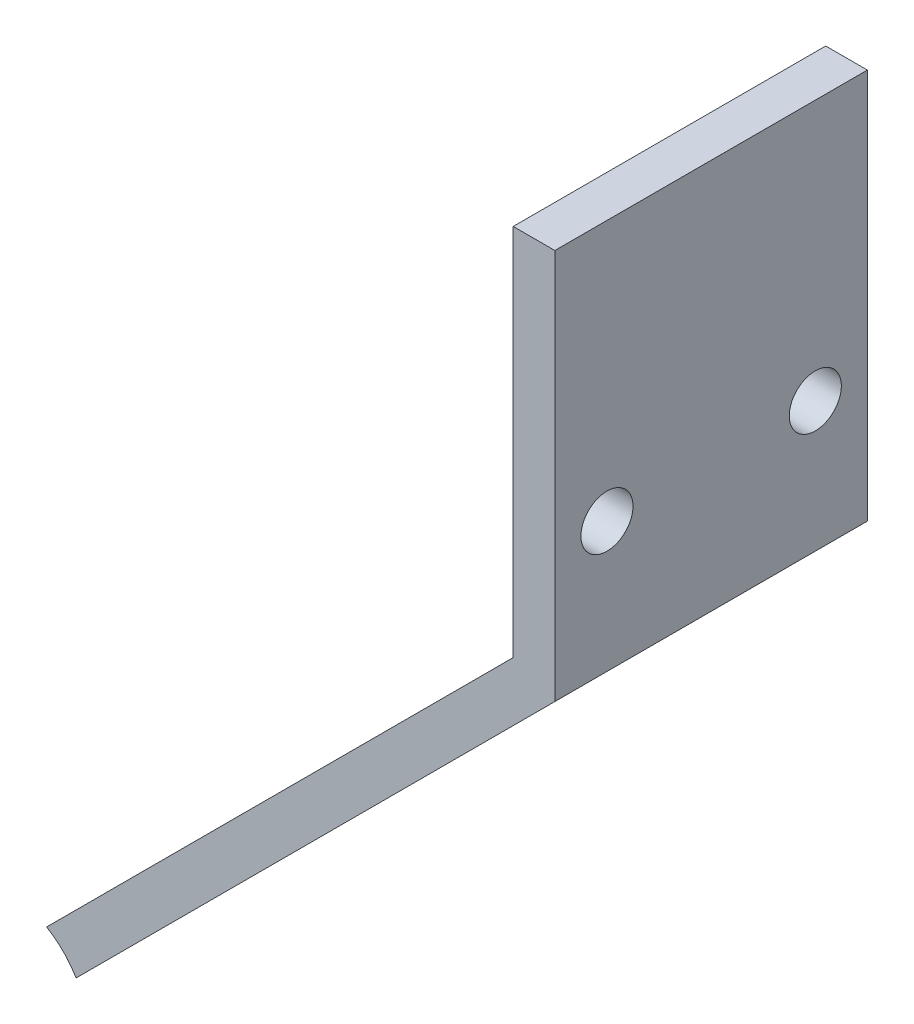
ISO-10303-21;
HEADER;
FILE_DESCRIPTION(('STEP AP214'),'2;1');
FILE_NAME('part.step','',(''),(''),'','','');
FILE_SCHEMA(('AUTOMOTIVE_DESIGN { 1 0 10303 214 1 1 1 1 }'));
ENDSEC;
DATA;
#1=APPLICATION_CONTEXT('core data for automotive mechanical design processes');
#2=APPLICATION_PROTOCOL_DEFINITION('international standard','automotive_design',2000,#1);
#3=PRODUCT_CONTEXT('',#1,'mechanical');
#4=PRODUCT('Part','Part','',(#3));
#5=PRODUCT_RELATED_PRODUCT_CATEGORY('part','',(#4));
#6=PRODUCT_DEFINITION_FORMATION('','',#4);
#7=PRODUCT_DEFINITION_CONTEXT('part definition',#1,'design');
#8=PRODUCT_DEFINITION('design','',#6,#7);
#9=PRODUCT_DEFINITION_SHAPE('','',#8);
#10=(LENGTH_UNIT() NAMED_UNIT(*) SI_UNIT(.MILLI.,.METRE.));
#11=(NAMED_UNIT(*) PLANE_ANGLE_UNIT() SI_UNIT($,.RADIAN.));
#12=(NAMED_UNIT(*) SI_UNIT($,.STERADIAN.) SOLID_ANGLE_UNIT());
#13=UNCERTAINTY_MEASURE_WITH_UNIT(LENGTH_MEASURE(1.E-05),#10,'distance_accuracy_value','');
#14=(GEOMETRIC_REPRESENTATION_CONTEXT(3) GLOBAL_UNCERTAINTY_ASSIGNED_CONTEXT((#13)) GLOBAL_UNIT_ASSIGNED_CONTEXT((#10,
#11,#12)) REPRESENTATION_CONTEXT('',''));
#15=CARTESIAN_POINT('',(0.,0.,0.));
#16=DIRECTION('',(0.,0.,1.));
#17=DIRECTION('',(1.,0.,0.));
#18=AXIS2_PLACEMENT_3D('',#15,#16,#17);
#19=CARTESIAN_POINT('',(0.,42.0773736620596,60.));
#20=DIRECTION('',(0.,0.,1.));
#21=DIRECTION('',(1.,0.,0.));
#22=AXIS2_PLACEMENT_3D('',#19,#20,#21);
#23=PLANE('',#22);
#24=DIRECTION('',(-0.707106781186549,-0.707106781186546,0.));
#25=VECTOR('',#24,1.);
#26=CARTESIAN_POINT('',(-89.5807358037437,-119.189653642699,60.));
#27=LINE('',#26,#25);
#28=CARTESIAN_POINT('',(0.,-29.6089178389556,60.));
#29=VERTEX_POINT('',#28);
#30=CARTESIAN_POINT('',(-89.5807358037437,-119.189653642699,60.));
#31=VERTEX_POINT('',#30);
#32=EDGE_CURVE('E128',#29,#31,#27,.T.);
#33=ORIENTED_EDGE('',*,*,#32,.T.);
#34=CARTESIAN_POINT('',(-97.7067598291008,-132.972531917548,60.));
#35=DIRECTION('',(0.,0.,1.));
#36=DIRECTION('',(1.,0.,0.));
#37=AXIS2_PLACEMENT_3D('',#34,#35,#36);
#38=CIRCLE('',#37,16.);
#39=CARTESIAN_POINT('',(-83.9238815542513,-124.846507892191,60.));
#40=VERTEX_POINT('',#39);
#41=EDGE_CURVE('E103',#31,#40,#38,.F.);
#42=ORIENTED_EDGE('',*,*,#41,.T.);
#43=DIRECTION('',(0.707106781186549,0.707106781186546,0.));
#44=VECTOR('',#43,1.);
#45=CARTESIAN_POINT('',(8.00000000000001,-32.9226263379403,60.));
#46=LINE('',#45,#44);
#47=CARTESIAN_POINT('',(8.00000000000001,-32.9226263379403,60.));
#48=VERTEX_POINT('',#47);
#49=EDGE_CURVE('E107',#40,#48,#46,.T.);
#50=ORIENTED_EDGE('',*,*,#49,.T.);
#51=DIRECTION('',(0.,1.,0.));
#52=VECTOR('',#51,1.);
#53=CARTESIAN_POINT('',(8.,42.0773736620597,60.));
#54=LINE('',#53,#52);
#55=CARTESIAN_POINT('',(8.,42.0773736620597,60.));
#56=VERTEX_POINT('',#55);
#57=EDGE_CURVE('E49',#48,#56,#54,.T.);
#58=ORIENTED_EDGE('',*,*,#57,.T.);
#59=DIRECTION('',(-1.,0.,0.));
#60=VECTOR('',#59,1.);
#61=CARTESIAN_POINT('',(0.,42.0773736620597,60.));
#62=LINE('',#61,#60);
#63=CARTESIAN_POINT('',(0.,42.0773736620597,60.));
#64=VERTEX_POINT('',#63);
#65=EDGE_CURVE('E114',#56,#64,#62,.T.);
#66=ORIENTED_EDGE('',*,*,#65,.T.);
#67=DIRECTION('',(0.,-1.,0.));
#68=VECTOR('',#67,1.);
#69=CARTESIAN_POINT('',(0.,-29.6089178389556,60.));
#70=LINE('',#69,#68);
#71=EDGE_CURVE('E83',#64,#29,#70,.T.);
#72=ORIENTED_EDGE('',*,*,#71,.T.);
#73=EDGE_LOOP('',(#33,#42,#50,#58,#66,#72));
#74=FACE_BOUND('',#73,.T.);
#75=ADVANCED_FACE('F32',(#74),#23,.T.);
#76=CARTESIAN_POINT('',(0.,42.0773736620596,0.));
#77=DIRECTION('',(0.,0.,1.));
#78=DIRECTION('',(1.,0.,0.));
#79=AXIS2_PLACEMENT_3D('',#76,#77,#78);
#80=PLANE('',#79);
#81=CARTESIAN_POINT('',(-97.7067598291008,-132.972531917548,0.));
#82=DIRECTION('',(0.,0.,1.));
#83=DIRECTION('',(1.,0.,0.));
#84=AXIS2_PLACEMENT_3D('',#81,#82,#83);
#85=CIRCLE('',#84,16.);
#86=CARTESIAN_POINT('',(-83.9238815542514,-124.846507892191,0.));
#87=VERTEX_POINT('',#86);
#88=CARTESIAN_POINT('',(-89.5807358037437,-119.189653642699,0.));
#89=VERTEX_POINT('',#88);
#90=EDGE_CURVE('E94',#87,#89,#85,.T.);
#91=ORIENTED_EDGE('',*,*,#90,.T.);
#92=DIRECTION('',(-0.707106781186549,-0.707106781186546,0.));
#93=VECTOR('',#92,1.);
#94=CARTESIAN_POINT('',(-89.5807358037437,-119.189653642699,0.));
#95=LINE('',#94,#93);
#96=CARTESIAN_POINT('',(0.,-29.6089178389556,0.));
#97=VERTEX_POINT('',#96);
#98=EDGE_CURVE('E112',#97,#89,#95,.T.);
#99=ORIENTED_EDGE('',*,*,#98,.F.);
#100=DIRECTION('',(0.,-1.,0.));
#101=VECTOR('',#100,1.);
#102=CARTESIAN_POINT('',(0.,-29.6089178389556,0.));
#103=LINE('',#102,#101);
#104=CARTESIAN_POINT('',(0.,42.0773736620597,0.));
#105=VERTEX_POINT('',#104);
#106=EDGE_CURVE('E116',#105,#97,#103,.T.);
#107=ORIENTED_EDGE('',*,*,#106,.F.);
#108=DIRECTION('',(-1.,0.,0.));
#109=VECTOR('',#108,1.);
#110=CARTESIAN_POINT('',(0.,42.0773736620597,0.));
#111=LINE('',#110,#109);
#112=CARTESIAN_POINT('',(8.,42.0773736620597,0.));
#113=VERTEX_POINT('',#112);
#114=EDGE_CURVE('E130',#113,#105,#111,.T.);
#115=ORIENTED_EDGE('',*,*,#114,.F.);
#116=DIRECTION('',(0.,1.,0.));
#117=VECTOR('',#116,1.);
#118=CARTESIAN_POINT('',(8.,42.0773736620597,0.));
#119=LINE('',#118,#117);
#120=CARTESIAN_POINT('',(8.00000000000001,-32.9226263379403,0.));
#121=VERTEX_POINT('',#120);
#122=EDGE_CURVE('E76',#121,#113,#119,.T.);
#123=ORIENTED_EDGE('',*,*,#122,.F.);
#124=DIRECTION('',(0.707106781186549,0.707106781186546,0.));
#125=VECTOR('',#124,1.);
#126=CARTESIAN_POINT('',(8.00000000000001,-32.9226263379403,0.));
#127=LINE('',#126,#125);
#128=EDGE_CURVE('E70',#87,#121,#127,.T.);
#129=ORIENTED_EDGE('',*,*,#128,.F.);
#130=EDGE_LOOP('',(#91,#99,#107,#115,#123,#129));
#131=FACE_BOUND('',#130,.T.);
#132=ADVANCED_FACE('F110',(#131),#80,.F.);
#133=CARTESIAN_POINT('',(0.,42.0773736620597,60.));
#134=DIRECTION('',(0.,-1.,0.));
#135=DIRECTION('',(0.,0.,-1.));
#136=AXIS2_PLACEMENT_3D('',#133,#134,#135);
#137=PLANE('',#136);
#138=ORIENTED_EDGE('',*,*,#114,.T.);
#139=DIRECTION('',(0.,0.,-1.));
#140=VECTOR('',#139,1.);
#141=CARTESIAN_POINT('',(0.,42.0773736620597,60.));
#142=LINE('',#141,#140);
#143=EDGE_CURVE('E11',#64,#105,#142,.T.);
#144=ORIENTED_EDGE('',*,*,#143,.F.);
#145=ORIENTED_EDGE('',*,*,#65,.F.);
#146=DIRECTION('',(0.,0.,-1.));
#147=VECTOR('',#146,1.);
#148=CARTESIAN_POINT('',(8.,42.0773736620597,60.));
#149=LINE('',#148,#147);
#150=EDGE_CURVE('E120',#56,#113,#149,.T.);
#151=ORIENTED_EDGE('',*,*,#150,.T.);
#152=EDGE_LOOP('',(#138,#144,#145,#151));
#153=FACE_BOUND('',#152,.T.);
#154=ADVANCED_FACE('F34',(#153),#137,.F.);
#155=CARTESIAN_POINT('',(0.,-29.6089178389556,60.));
#156=DIRECTION('',(1.,0.,0.));
#157=DIRECTION('',(0.,1.,0.));
#158=AXIS2_PLACEMENT_3D('',#155,#156,#157);
#159=PLANE('',#158);
#160=CARTESIAN_POINT('',(0.,-7.92262633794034,10.));
#161=DIRECTION('',(1.,0.,0.));
#162=DIRECTION('',(0.,1.,0.));
#163=AXIS2_PLACEMENT_3D('',#160,#161,#162);
#164=CIRCLE('',#163,5.);
#165=CARTESIAN_POINT('',(0.,-2.92262633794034,10.));
#166=VERTEX_POINT('',#165);
#167=EDGE_CURVE('E148',#166,#166,#164,.T.);
#168=ORIENTED_EDGE('',*,*,#167,.T.);
#169=EDGE_LOOP('',(#168));
#170=FACE_BOUND('',#169,.T.);
#171=CARTESIAN_POINT('',(0.,-7.92262633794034,50.));
#172=DIRECTION('',(1.,0.,0.));
#173=DIRECTION('',(0.,1.,0.));
#174=AXIS2_PLACEMENT_3D('',#171,#172,#173);
#175=CIRCLE('',#174,5.);
#176=CARTESIAN_POINT('',(0.,-2.92262633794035,50.));
#177=VERTEX_POINT('',#176);
#178=EDGE_CURVE('E135',#177,#177,#175,.T.);
#179=ORIENTED_EDGE('',*,*,#178,.T.);
#180=EDGE_LOOP('',(#179));
#181=FACE_BOUND('',#180,.T.);
#182=ORIENTED_EDGE('',*,*,#106,.T.);
#183=DIRECTION('',(0.,0.,-1.));
#184=VECTOR('',#183,1.);
#185=CARTESIAN_POINT('',(0.,-29.6089178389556,60.));
#186=LINE('',#185,#184);
#187=EDGE_CURVE('E41',#29,#97,#186,.T.);
#188=ORIENTED_EDGE('',*,*,#187,.F.);
#189=ORIENTED_EDGE('',*,*,#71,.F.);
#190=ORIENTED_EDGE('',*,*,#143,.T.);
#191=EDGE_LOOP('',(#182,#188,#189,#190));
#192=FACE_BOUND('',#191,.T.);
#193=ADVANCED_FACE('F132',(#170,#181,#192),#159,.F.);
#194=CARTESIAN_POINT('',(-89.5807358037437,-119.189653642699,60.));
#195=DIRECTION('',(0.707106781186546,-0.707106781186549,0.));
#196=DIRECTION('',(0.707106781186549,0.707106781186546,0.));
#197=AXIS2_PLACEMENT_3D('',#194,#195,#196);
#198=PLANE('',#197);
#199=ORIENTED_EDGE('',*,*,#98,.T.);
#200=DIRECTION('',(0.,0.,-1.));
#201=VECTOR('',#200,1.);
#202=CARTESIAN_POINT('',(-89.5807358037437,-119.189653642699,60.));
#203=LINE('',#202,#201);
#204=EDGE_CURVE('E99',#31,#89,#203,.T.);
#205=ORIENTED_EDGE('',*,*,#204,.F.);
#206=ORIENTED_EDGE('',*,*,#32,.F.);
#207=ORIENTED_EDGE('',*,*,#187,.T.);
#208=EDGE_LOOP('',(#199,#205,#206,#207));
#209=FACE_BOUND('',#208,.T.);
#210=ADVANCED_FACE('F126',(#209),#198,.F.);
#211=CARTESIAN_POINT('',(8.00000000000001,-32.9226263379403,60.));
#212=DIRECTION('',(-0.707106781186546,0.707106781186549,0.));
#213=DIRECTION('',(-0.707106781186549,-0.707106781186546,0.));
#214=AXIS2_PLACEMENT_3D('',#211,#212,#213);
#215=PLANE('',#214);
#216=ORIENTED_EDGE('',*,*,#128,.T.);
#217=DIRECTION('',(0.,0.,-1.));
#218=VECTOR('',#217,1.);
#219=CARTESIAN_POINT('',(8.00000000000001,-32.9226263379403,60.));
#220=LINE('',#219,#218);
#221=EDGE_CURVE('E108',#48,#121,#220,.T.);
#222=ORIENTED_EDGE('',*,*,#221,.F.);
#223=ORIENTED_EDGE('',*,*,#49,.F.);
#224=DIRECTION('',(0.,0.,-1.));
#225=VECTOR('',#224,1.);
#226=CARTESIAN_POINT('',(-83.9238815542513,-124.846507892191,60.));
#227=LINE('',#226,#225);
#228=EDGE_CURVE('E96',#40,#87,#227,.T.);
#229=ORIENTED_EDGE('',*,*,#228,.T.);
#230=EDGE_LOOP('',(#216,#222,#223,#229));
#231=FACE_BOUND('',#230,.T.);
#232=ADVANCED_FACE('F106',(#231),#215,.F.);
#233=CARTESIAN_POINT('',(8.,42.0773736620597,60.));
#234=DIRECTION('',(-1.,0.,0.));
#235=DIRECTION('',(0.,-1.,0.));
#236=AXIS2_PLACEMENT_3D('',#233,#234,#235);
#237=PLANE('',#236);
#238=CARTESIAN_POINT('',(8.00000000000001,-7.92262633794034,10.));
#239=DIRECTION('',(1.,0.,0.));
#240=DIRECTION('',(0.,1.,0.));
#241=AXIS2_PLACEMENT_3D('',#238,#239,#240);
#242=CIRCLE('',#241,5.);
#243=CARTESIAN_POINT('',(8.00000000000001,-2.92262633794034,10.));
#244=VERTEX_POINT('',#243);
#245=EDGE_CURVE('E151',#244,#244,#242,.T.);
#246=ORIENTED_EDGE('',*,*,#245,.F.);
#247=EDGE_LOOP('',(#246));
#248=FACE_BOUND('',#247,.T.);
#249=CARTESIAN_POINT('',(8.00000000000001,-7.92262633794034,50.));
#250=DIRECTION('',(1.,0.,0.));
#251=DIRECTION('',(0.,1.,0.));
#252=AXIS2_PLACEMENT_3D('',#249,#250,#251);
#253=CIRCLE('',#252,5.);
#254=CARTESIAN_POINT('',(8.00000000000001,-2.92262633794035,50.));
#255=VERTEX_POINT('',#254);
#256=EDGE_CURVE('E138',#255,#255,#253,.T.);
#257=ORIENTED_EDGE('',*,*,#256,.F.);
#258=EDGE_LOOP('',(#257));
#259=FACE_BOUND('',#258,.T.);
#260=ORIENTED_EDGE('',*,*,#122,.T.);
#261=ORIENTED_EDGE('',*,*,#150,.F.);
#262=ORIENTED_EDGE('',*,*,#57,.F.);
#263=ORIENTED_EDGE('',*,*,#221,.T.);
#264=EDGE_LOOP('',(#260,#261,#262,#263));
#265=FACE_BOUND('',#264,.T.);
#266=ADVANCED_FACE('F154',(#248,#259,#265),#237,.F.);
#267=CARTESIAN_POINT('',(-89.5807358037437,-7.92262633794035,50.));
#268=DIRECTION('',(1.,0.,0.));
#269=DIRECTION('',(0.,1.,0.));
#270=AXIS2_PLACEMENT_3D('',#267,#268,#269);
#271=CYLINDRICAL_SURFACE('',#270,5.);
#272=ORIENTED_EDGE('',*,*,#256,.T.);
#273=EDGE_LOOP('',(#272));
#274=FACE_BOUND('',#273,.T.);
#275=ORIENTED_EDGE('',*,*,#178,.F.);
#276=EDGE_LOOP('',(#275));
#277=FACE_BOUND('',#276,.T.);
#278=ADVANCED_FACE('F156',(#274,#277),#271,.F.);
#279=CARTESIAN_POINT('',(-89.5807358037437,-7.92262633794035,10.));
#280=DIRECTION('',(1.,0.,0.));
#281=DIRECTION('',(0.,1.,0.));
#282=AXIS2_PLACEMENT_3D('',#279,#280,#281);
#283=CYLINDRICAL_SURFACE('',#282,5.);
#284=ORIENTED_EDGE('',*,*,#245,.T.);
#285=EDGE_LOOP('',(#284));
#286=FACE_BOUND('',#285,.T.);
#287=ORIENTED_EDGE('',*,*,#167,.F.);
#288=EDGE_LOOP('',(#287));
#289=FACE_BOUND('',#288,.T.);
#290=ADVANCED_FACE('F163',(#286,#289),#283,.F.);
#291=CARTESIAN_POINT('',(-97.7067598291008,-132.972531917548,150.));
#292=DIRECTION('',(0.,0.,-1.));
#293=DIRECTION('',(-1.,0.,0.));
#294=AXIS2_PLACEMENT_3D('',#291,#292,#293);
#295=CYLINDRICAL_SURFACE('',#294,16.);
#296=ORIENTED_EDGE('',*,*,#204,.T.);
#297=ORIENTED_EDGE('',*,*,#90,.F.);
#298=ORIENTED_EDGE('',*,*,#228,.F.);
#299=ORIENTED_EDGE('',*,*,#41,.F.);
#300=EDGE_LOOP('',(#296,#297,#298,#299));
#301=FACE_BOUND('',#300,.T.);
#302=ADVANCED_FACE('F95',(#301),#295,.F.);
#303=CLOSED_SHELL('',(#75,#132,#154,#193,#210,#232,#266,#278,#290,#302));
#304=MANIFOLD_SOLID_BREP('B2',#303);
#305=ADVANCED_BREP_SHAPE_REPRESENTATION('',(#18,#304),#14);
#306=SHAPE_DEFINITION_REPRESENTATION(#9,#305);
ENDSEC;
END-ISO-10303-21;
